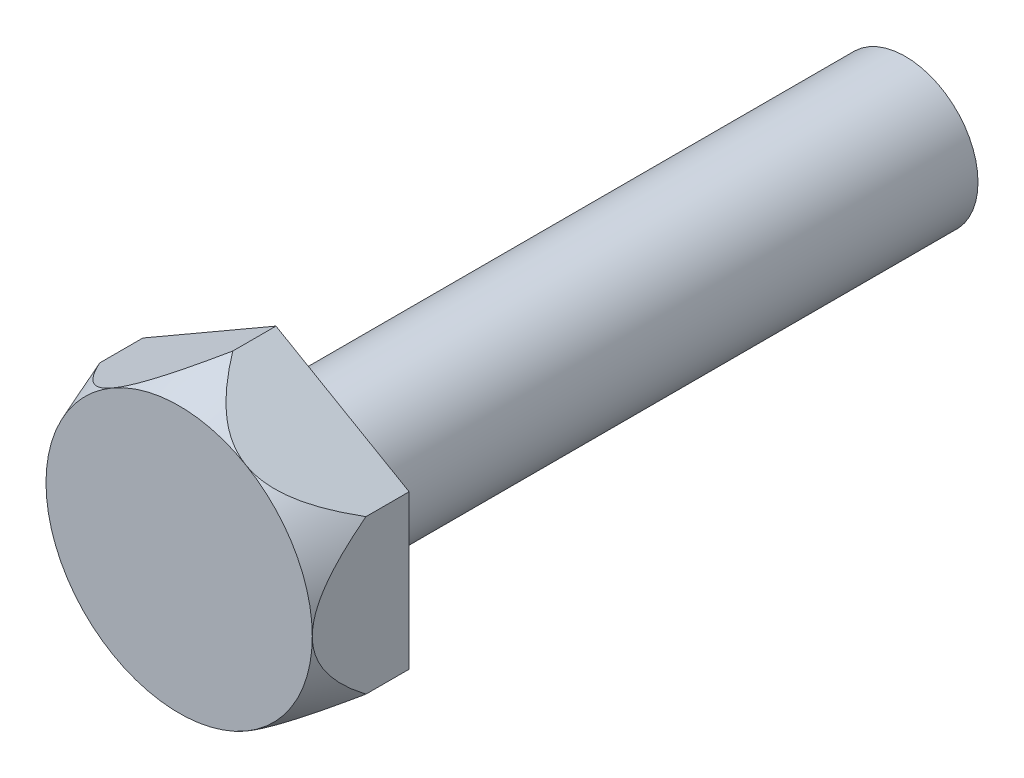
from build123d import *

# Parameters (mm, degrees)
BOSS_EXTRUDE1_DEPTH = 2
SKETCH2_OUTSIDE_W   = 13.566
SKETCH2_OUTSIDE_H   = 14.416
SKETCH2_OUTSIDE_R   = 2.75
CUT_EXTRUDE1_DEPTH  = 5.652508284
CUT_EXTRUDE1_DRAFT  = -21
SKETCH3_R           = 1.5
BOSS_EXTRUDE2_DEPTH = 13


with BuildPart() as part:
    # Sketch1 → Boss-Extrude1 (new body)
    with BuildSketch(Plane.XY):
        Polygon((0, 3.175426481), (-2.75, 1.58771324), (-2.75, -1.58771324), (0, -3.175426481), (2.75, -1.58771324), (2.75, 1.58771324), align=None)
    extrude(amount=BOSS_EXTRUDE1_DEPTH)


with BuildPart() as cut_extrude1_tool:
    # Sketch2 outside → Cut-Extrude1 (with draft: the straight prism first)
    with BuildSketch(Plane.XY.offset(2)):
        Rectangle(SKETCH2_OUTSIDE_W, SKETCH2_OUTSIDE_H)
        Circle(SKETCH2_OUTSIDE_R, mode=Mode.SUBTRACT)
    extrude(amount=-CUT_EXTRUDE1_DEPTH)
    # Cut-Extrude1: the draft: its side faces are tilted about the plane it starts from
    cut_extrude1_sides = [cut_extrude1_tool.faces().sort_by_distance(p)[0] for p in [
        (0, -7.208, -0.826254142),
        (6.783, 0, -0.826254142),
        (0, 7.208, -0.826254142),
        (-6.783, 0, -0.826254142),
        (-2.75, 0, -0.826254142),
    ]]
    draft(cut_extrude1_sides, Plane.XY.offset(2), CUT_EXTRUDE1_DRAFT)


with BuildPart() as part_1:
    add(part.part)

    # Cut-Extrude1: cut by cut_extrude1_tool
    add(cut_extrude1_tool.part, mode=Mode.SUBTRACT)

    # Sketch3 → Boss-Extrude2 (add)
    with BuildSketch(Plane(origin=(0, 0, 0), x_dir=(-1, 0, 0), z_dir=(0, 0, -1))):
        with Locations(Location((0, 0, 0), (0, 0, 180))):
            Circle(SKETCH3_R)
    extrude(amount=BOSS_EXTRUDE2_DEPTH)


solid = part_1.part
